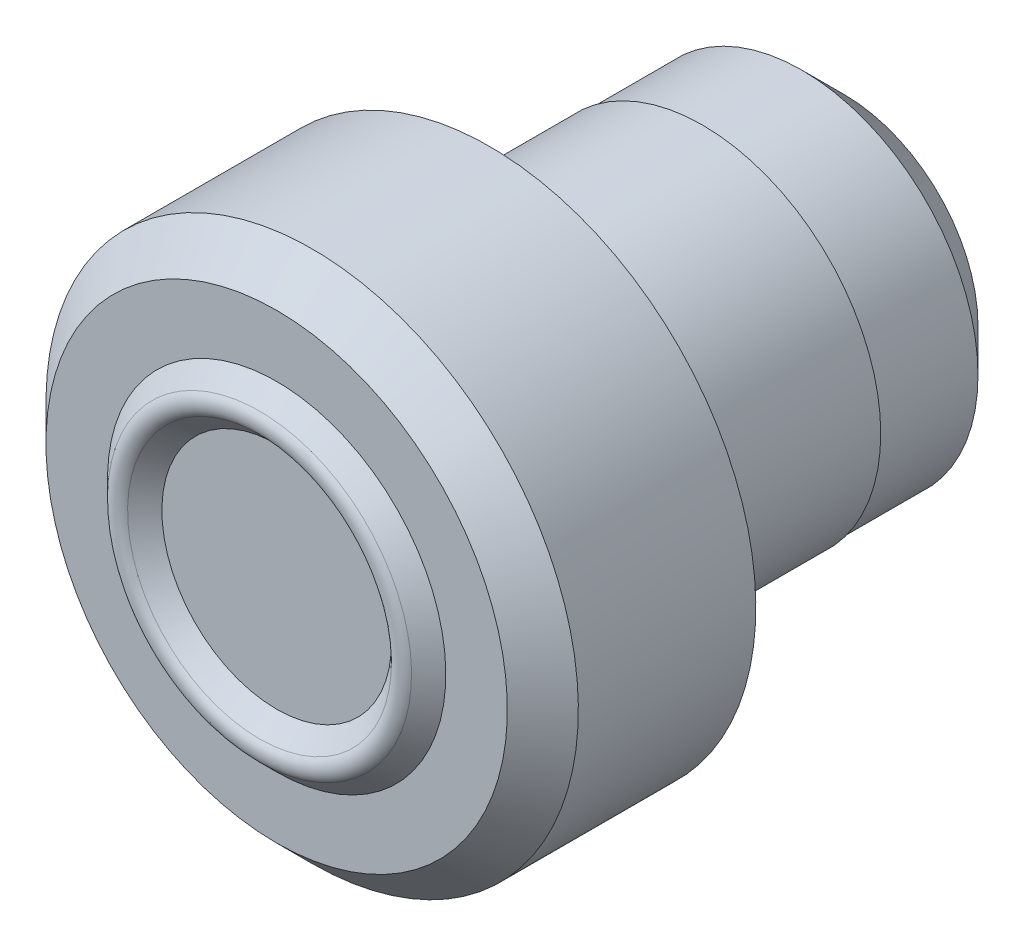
ISO-10303-21;
HEADER;
FILE_DESCRIPTION(('STEP AP214'),'2;1');
FILE_NAME('part.step','',(''),(''),'','','');
FILE_SCHEMA(('AUTOMOTIVE_DESIGN { 1 0 10303 214 1 1 1 1 }'));
ENDSEC;
DATA;
#1=APPLICATION_CONTEXT('core data for automotive mechanical design processes');
#2=APPLICATION_PROTOCOL_DEFINITION('international standard','automotive_design',2000,#1);
#3=PRODUCT_CONTEXT('',#1,'mechanical');
#4=PRODUCT('Part','Part','',(#3));
#5=PRODUCT_RELATED_PRODUCT_CATEGORY('part','',(#4));
#6=PRODUCT_DEFINITION_FORMATION('','',#4);
#7=PRODUCT_DEFINITION_CONTEXT('part definition',#1,'design');
#8=PRODUCT_DEFINITION('design','',#6,#7);
#9=PRODUCT_DEFINITION_SHAPE('','',#8);
#10=(LENGTH_UNIT() NAMED_UNIT(*) SI_UNIT(.MILLI.,.METRE.));
#11=(NAMED_UNIT(*) PLANE_ANGLE_UNIT() SI_UNIT($,.RADIAN.));
#12=(NAMED_UNIT(*) SI_UNIT($,.STERADIAN.) SOLID_ANGLE_UNIT());
#13=UNCERTAINTY_MEASURE_WITH_UNIT(LENGTH_MEASURE(1.E-05),#10,'distance_accuracy_value','');
#14=(GEOMETRIC_REPRESENTATION_CONTEXT(3) GLOBAL_UNCERTAINTY_ASSIGNED_CONTEXT((#13)) GLOBAL_UNIT_ASSIGNED_CONTEXT((#10,
#11,#12)) REPRESENTATION_CONTEXT('',''));
#15=CARTESIAN_POINT('',(0.,0.,0.));
#16=DIRECTION('',(0.,0.,1.));
#17=DIRECTION('',(1.,0.,0.));
#18=AXIS2_PLACEMENT_3D('',#15,#16,#17);
#19=CARTESIAN_POINT('',(0.,3.25,3.));
#20=DIRECTION('',(0.,0.,-1.));
#21=DIRECTION('',(0.,1.,0.));
#22=AXIS2_PLACEMENT_3D('',#19,#20,#21);
#23=PLANE('',#22);
#24=CARTESIAN_POINT('',(0.,0.,3.));
#25=DIRECTION('',(0.,0.,1.));
#26=DIRECTION('',(0.,-1.,0.));
#27=AXIS2_PLACEMENT_3D('',#24,#25,#26);
#28=CIRCLE('',#27,2.38284271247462);
#29=CARTESIAN_POINT('',(0.,-2.38284271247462,3.));
#30=VERTEX_POINT('',#29);
#31=EDGE_CURVE('E22',#30,#30,#28,.T.);
#32=ORIENTED_EDGE('',*,*,#31,.F.);
#33=EDGE_LOOP('',(#32));
#34=FACE_BOUND('',#33,.T.);
#35=CARTESIAN_POINT('',(0.,0.,3.));
#36=DIRECTION('',(0.,0.,1.));
#37=DIRECTION('',(0.,-1.,0.));
#38=AXIS2_PLACEMENT_3D('',#35,#36,#37);
#39=CIRCLE('',#38,3.25);
#40=CARTESIAN_POINT('',(0.,-3.25,3.));
#41=VERTEX_POINT('',#40);
#42=EDGE_CURVE('E52',#41,#41,#39,.T.);
#43=ORIENTED_EDGE('',*,*,#42,.T.);
#44=EDGE_LOOP('',(#43));
#45=FACE_BOUND('',#44,.T.);
#46=ADVANCED_FACE('F12',(#34,#45),#23,.F.);
#47=CARTESIAN_POINT('',(0.,0.,3.));
#48=DIRECTION('',(0.,0.,-1.));
#49=DIRECTION('',(0.,1.,0.));
#50=AXIS2_PLACEMENT_3D('',#47,#48,#49);
#51=CONICAL_SURFACE('',#50,2.38284271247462,0.785398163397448);
#52=CARTESIAN_POINT('',(0.,0.,3.24142135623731));
#53=DIRECTION('',(0.,0.,1.));
#54=DIRECTION('',(0.,-1.,0.));
#55=AXIS2_PLACEMENT_3D('',#52,#53,#54);
#56=CIRCLE('',#55,2.14142135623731);
#57=CARTESIAN_POINT('',(0.,-2.14142135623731,3.24142135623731));
#58=VERTEX_POINT('',#57);
#59=EDGE_CURVE('E26',#58,#58,#56,.T.);
#60=ORIENTED_EDGE('',*,*,#59,.F.);
#61=EDGE_LOOP('',(#60));
#62=FACE_BOUND('',#61,.T.);
#63=ORIENTED_EDGE('',*,*,#31,.T.);
#64=EDGE_LOOP('',(#63));
#65=FACE_BOUND('',#64,.T.);
#66=ADVANCED_FACE('F75',(#62,#65),#51,.T.);
#67=CARTESIAN_POINT('',(0.,0.,3.1));
#68=DIRECTION('',(0.,0.,1.));
#69=DIRECTION('',(0.,-1.,0.));
#70=AXIS2_PLACEMENT_3D('',#67,#68,#69);
#71=TOROIDAL_SURFACE('',#70,2.,0.2);
#72=CARTESIAN_POINT('',(0.,0.,3.24142135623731));
#73=DIRECTION('',(0.,0.,1.));
#74=DIRECTION('',(0.,-1.,0.));
#75=AXIS2_PLACEMENT_3D('',#72,#73,#74);
#76=CIRCLE('',#75,1.85857864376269);
#77=CARTESIAN_POINT('',(0.,-1.85857864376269,3.24142135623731));
#78=VERTEX_POINT('',#77);
#79=EDGE_CURVE('E31',#78,#78,#76,.T.);
#80=ORIENTED_EDGE('',*,*,#79,.F.);
#81=EDGE_LOOP('',(#80));
#82=FACE_BOUND('',#81,.T.);
#83=ORIENTED_EDGE('',*,*,#59,.T.);
#84=EDGE_LOOP('',(#83));
#85=FACE_BOUND('',#84,.T.);
#86=ADVANCED_FACE('F81',(#82,#85),#71,.T.);
#87=CARTESIAN_POINT('',(0.,0.,3.24142135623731));
#88=DIRECTION('',(0.,0.,1.));
#89=DIRECTION('',(0.,-1.,0.));
#90=AXIS2_PLACEMENT_3D('',#87,#88,#89);
#91=CONICAL_SURFACE('',#90,1.85857864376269,0.785398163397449);
#92=CARTESIAN_POINT('',(0.,0.,3.));
#93=DIRECTION('',(0.,0.,1.));
#94=DIRECTION('',(0.,-1.,0.));
#95=AXIS2_PLACEMENT_3D('',#92,#93,#94);
#96=CIRCLE('',#95,1.61715728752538);
#97=CARTESIAN_POINT('',(0.,-1.61715728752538,3.));
#98=VERTEX_POINT('',#97);
#99=EDGE_CURVE('E34',#98,#98,#96,.T.);
#100=ORIENTED_EDGE('',*,*,#99,.F.);
#101=EDGE_LOOP('',(#100));
#102=FACE_BOUND('',#101,.T.);
#103=ORIENTED_EDGE('',*,*,#79,.T.);
#104=EDGE_LOOP('',(#103));
#105=FACE_BOUND('',#104,.T.);
#106=ADVANCED_FACE('F89',(#102,#105),#91,.F.);
#107=CARTESIAN_POINT('',(0.,1.61715728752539,3.));
#108=DIRECTION('',(0.,0.,-1.));
#109=DIRECTION('',(0.,1.,0.));
#110=AXIS2_PLACEMENT_3D('',#107,#108,#109);
#111=PLANE('',#110);
#112=ORIENTED_EDGE('',*,*,#99,.T.);
#113=EDGE_LOOP('',(#112));
#114=FACE_BOUND('',#113,.T.);
#115=ADVANCED_FACE('F96',(#114),#111,.F.);
#116=CARTESIAN_POINT('',(0.,2.48,-5.));
#117=DIRECTION('',(0.,0.,-1.));
#118=DIRECTION('',(0.,1.,0.));
#119=AXIS2_PLACEMENT_3D('',#116,#117,#118);
#120=PLANE('',#119);
#121=CARTESIAN_POINT('',(0.,0.,-5.));
#122=DIRECTION('',(0.,0.,-1.));
#123=DIRECTION('',(0.,1.,0.));
#124=AXIS2_PLACEMENT_3D('',#121,#122,#123);
#125=CIRCLE('',#124,1.88);
#126=CARTESIAN_POINT('',(0.,1.88,-5.));
#127=VERTEX_POINT('',#126);
#128=EDGE_CURVE('E8',#127,#127,#125,.T.);
#129=ORIENTED_EDGE('',*,*,#128,.T.);
#130=EDGE_LOOP('',(#129));
#131=FACE_BOUND('',#130,.T.);
#132=ADVANCED_FACE('F100',(#131),#120,.T.);
#133=CARTESIAN_POINT('',(0.,0.,3.));
#134=DIRECTION('',(0.,0.,1.));
#135=DIRECTION('',(0.,-1.,0.));
#136=AXIS2_PLACEMENT_3D('',#133,#134,#135);
#137=CYLINDRICAL_SURFACE('',#136,2.48);
#138=CARTESIAN_POINT('',(0.,0.,-4.4));
#139=DIRECTION('',(0.,0.,-1.));
#140=DIRECTION('',(-1.,0.,0.));
#141=AXIS2_PLACEMENT_3D('',#138,#139,#140);
#142=CIRCLE('',#141,2.48);
#143=CARTESIAN_POINT('',(-2.48,0.,-4.4));
#144=VERTEX_POINT('',#143);
#145=EDGE_CURVE('E18',#144,#144,#142,.F.);
#146=ORIENTED_EDGE('',*,*,#145,.T.);
#147=EDGE_LOOP('',(#146));
#148=FACE_BOUND('',#147,.T.);
#149=CARTESIAN_POINT('',(0.,0.,-3.));
#150=DIRECTION('',(0.,0.,1.));
#151=DIRECTION('',(0.,-1.,0.));
#152=AXIS2_PLACEMENT_3D('',#149,#150,#151);
#153=CIRCLE('',#152,2.48);
#154=CARTESIAN_POINT('',(0.,-2.48,-3.));
#155=VERTEX_POINT('',#154);
#156=EDGE_CURVE('E37',#155,#155,#153,.T.);
#157=ORIENTED_EDGE('',*,*,#156,.F.);
#158=EDGE_LOOP('',(#157));
#159=FACE_BOUND('',#158,.T.);
#160=ADVANCED_FACE('F104',(#148,#159),#137,.T.);
#161=CARTESIAN_POINT('',(0.,2.51,-3.));
#162=DIRECTION('',(0.,0.,-1.));
#163=DIRECTION('',(0.,1.,0.));
#164=AXIS2_PLACEMENT_3D('',#161,#162,#163);
#165=PLANE('',#164);
#166=ORIENTED_EDGE('',*,*,#156,.T.);
#167=EDGE_LOOP('',(#166));
#168=FACE_BOUND('',#167,.T.);
#169=CARTESIAN_POINT('',(0.,0.,-3.));
#170=DIRECTION('',(0.,0.,1.));
#171=DIRECTION('',(0.,-1.,0.));
#172=AXIS2_PLACEMENT_3D('',#169,#170,#171);
#173=CIRCLE('',#172,2.51);
#174=CARTESIAN_POINT('',(0.,-2.51,-3.));
#175=VERTEX_POINT('',#174);
#176=EDGE_CURVE('E40',#175,#175,#173,.T.);
#177=ORIENTED_EDGE('',*,*,#176,.F.);
#178=EDGE_LOOP('',(#177));
#179=FACE_BOUND('',#178,.T.);
#180=ADVANCED_FACE('F107',(#168,#179),#165,.T.);
#181=CARTESIAN_POINT('',(0.,0.,3.));
#182=DIRECTION('',(0.,0.,1.));
#183=DIRECTION('',(0.,-1.,0.));
#184=AXIS2_PLACEMENT_3D('',#181,#182,#183);
#185=CYLINDRICAL_SURFACE('',#184,2.51);
#186=ORIENTED_EDGE('',*,*,#176,.T.);
#187=EDGE_LOOP('',(#186));
#188=FACE_BOUND('',#187,.T.);
#189=CARTESIAN_POINT('',(0.,0.,0.));
#190=DIRECTION('',(0.,0.,1.));
#191=DIRECTION('',(0.,-1.,0.));
#192=AXIS2_PLACEMENT_3D('',#189,#190,#191);
#193=CIRCLE('',#192,2.51);
#194=CARTESIAN_POINT('',(0.,-2.51,0.));
#195=VERTEX_POINT('',#194);
#196=EDGE_CURVE('E43',#195,#195,#193,.T.);
#197=ORIENTED_EDGE('',*,*,#196,.F.);
#198=EDGE_LOOP('',(#197));
#199=FACE_BOUND('',#198,.T.);
#200=ADVANCED_FACE('F110',(#188,#199),#185,.T.);
#201=CARTESIAN_POINT('',(0.,3.75,0.));
#202=DIRECTION('',(0.,0.,-1.));
#203=DIRECTION('',(0.,1.,0.));
#204=AXIS2_PLACEMENT_3D('',#201,#202,#203);
#205=PLANE('',#204);
#206=ORIENTED_EDGE('',*,*,#196,.T.);
#207=EDGE_LOOP('',(#206));
#208=FACE_BOUND('',#207,.T.);
#209=CARTESIAN_POINT('',(0.,0.,0.));
#210=DIRECTION('',(0.,0.,1.));
#211=DIRECTION('',(0.,-1.,0.));
#212=AXIS2_PLACEMENT_3D('',#209,#210,#211);
#213=CIRCLE('',#212,3.75);
#214=CARTESIAN_POINT('',(0.,-3.75,0.));
#215=VERTEX_POINT('',#214);
#216=EDGE_CURVE('E46',#215,#215,#213,.T.);
#217=ORIENTED_EDGE('',*,*,#216,.F.);
#218=EDGE_LOOP('',(#217));
#219=FACE_BOUND('',#218,.T.);
#220=ADVANCED_FACE('F71',(#208,#219),#205,.T.);
#221=CARTESIAN_POINT('',(0.,0.,3.));
#222=DIRECTION('',(0.,0.,1.));
#223=DIRECTION('',(0.,-1.,0.));
#224=AXIS2_PLACEMENT_3D('',#221,#222,#223);
#225=CYLINDRICAL_SURFACE('',#224,3.75);
#226=ORIENTED_EDGE('',*,*,#216,.T.);
#227=EDGE_LOOP('',(#226));
#228=FACE_BOUND('',#227,.T.);
#229=CARTESIAN_POINT('',(0.,0.,2.5));
#230=DIRECTION('',(0.,0.,1.));
#231=DIRECTION('',(0.,-1.,0.));
#232=AXIS2_PLACEMENT_3D('',#229,#230,#231);
#233=CIRCLE('',#232,3.75);
#234=CARTESIAN_POINT('',(0.,-3.75,2.5));
#235=VERTEX_POINT('',#234);
#236=EDGE_CURVE('E49',#235,#235,#233,.T.);
#237=ORIENTED_EDGE('',*,*,#236,.F.);
#238=EDGE_LOOP('',(#237));
#239=FACE_BOUND('',#238,.T.);
#240=ADVANCED_FACE('F60',(#228,#239),#225,.T.);
#241=CARTESIAN_POINT('',(0.,0.,3.));
#242=DIRECTION('',(0.,0.,-1.));
#243=DIRECTION('',(0.,1.,0.));
#244=AXIS2_PLACEMENT_3D('',#241,#242,#243);
#245=CONICAL_SURFACE('',#244,3.25,0.785398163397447);
#246=ORIENTED_EDGE('',*,*,#236,.T.);
#247=EDGE_LOOP('',(#246));
#248=FACE_BOUND('',#247,.T.);
#249=ORIENTED_EDGE('',*,*,#42,.F.);
#250=EDGE_LOOP('',(#249));
#251=FACE_BOUND('',#250,.T.);
#252=ADVANCED_FACE('F57',(#248,#251),#245,.T.);
#253=CARTESIAN_POINT('',(0.,0.,-4.4));
#254=DIRECTION('',(0.,0.,1.));
#255=DIRECTION('',(1.,0.,0.));
#256=AXIS2_PLACEMENT_3D('',#253,#254,#255);
#257=CONICAL_SURFACE('',#256,2.48,0.785398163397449);
#258=ORIENTED_EDGE('',*,*,#128,.F.);
#259=EDGE_LOOP('',(#258));
#260=FACE_BOUND('',#259,.T.);
#261=ORIENTED_EDGE('',*,*,#145,.F.);
#262=EDGE_LOOP('',(#261));
#263=FACE_BOUND('',#262,.T.);
#264=ADVANCED_FACE('F59',(#260,#263),#257,.T.);
#265=CLOSED_SHELL('',(#46,#66,#86,#106,#115,#132,#160,#180,#200,#220,#240,#252,#264));
#266=MANIFOLD_SOLID_BREP('B1',#265);
#267=ADVANCED_BREP_SHAPE_REPRESENTATION('',(#18,#266),#14);
#268=SHAPE_DEFINITION_REPRESENTATION(#9,#267);
ENDSEC;
END-ISO-10303-21;
